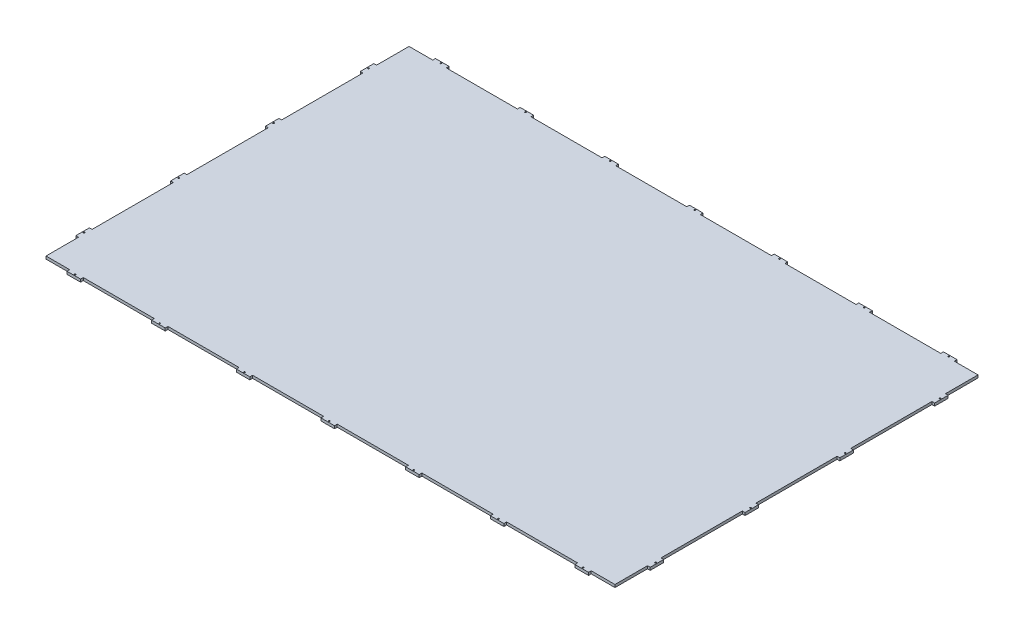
from build123d import *

# Parameters (mm, degrees)
SKIZZE1_W                       = 848
SKIZZE1_H                       = 544
AUFSATZ_LINEAR_AUSTRAGEN1_DEPTH = 4
SKIZZE2_W                       = 39
SKIZZE2_H                       = 4
SKIZZE2_W_2                     = 105
SCHNITT_LINEAR_AUSTRAGEN1_DEPTH = 504.761848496
SKIZZE3_W                       = 4
SKIZZE3_H                       = 48
SKIZZE3_H_2                     = 120
SCHNITT_LINEAR_AUSTRAGEN2_DEPTH = 504.761848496
F_2_0_2_DURCHMESSER_BOHRUNG1_D  = 2


with BuildPart() as part:
    # Skizze1 → Aufsatz-Linear austragen1 (new body)
    with BuildSketch(Plane(origin=(0, 0, 0), x_dir=(1, 0, 0), z_dir=(0, 1, 0))):
        Rectangle(SKIZZE1_W, SKIZZE1_H)
    extrude(amount=AUFSATZ_LINEAR_AUSTRAGEN1_DEPTH)

    # Skizze2 → Schnitt-Linear austragen1 (cut, through all)
    with BuildSketch(Plane(origin=(0, 4, 0), x_dir=(1, 0, 0), z_dir=(0, 1, 0))):
        with Locations((-404.5, -270)):
            Rectangle(SKIZZE2_W, SKIZZE2_H)
        with Locations((-312.5, -270)):
            Rectangle(SKIZZE2_W_2, SKIZZE2_H)
        with Locations((-187.5, -270)):
            Rectangle(SKIZZE2_W_2, SKIZZE2_H)
        with Locations((-62.5, -270)):
            Rectangle(SKIZZE2_W_2, SKIZZE2_H)
        with Locations((62.5, -270)):
            Rectangle(SKIZZE2_W_2, SKIZZE2_H)
        with Locations((187.5, -270)):
            Rectangle(SKIZZE2_W_2, SKIZZE2_H)
        with Locations((312.5, -270)):
            Rectangle(SKIZZE2_W_2, SKIZZE2_H)
        with Locations((404.5, -270)):
            Rectangle(SKIZZE2_W, SKIZZE2_H)
    schnitt_linear_austragen1 = extrude(amount=-SCHNITT_LINEAR_AUSTRAGEN1_DEPTH, mode=Mode.SUBTRACT)

    # Spiegeln1: Schnitt-Linear austragen1 across plane
    add(schnitt_linear_austragen1.mirror(Plane.XY), mode=Mode.SUBTRACT)

    # Skizze3 → Schnitt-Linear austragen2 (cut, through all)
    with BuildSketch(Plane(origin=(0, 4, 0), x_dir=(1, 0, 0), z_dir=(0, 1, 0))):
        with Locations((-422, 244)):
            Rectangle(SKIZZE3_W, SKIZZE3_H)
        with Locations((-422, 140)):
            Rectangle(SKIZZE3_W, SKIZZE3_H_2)
        with Locations((-422, 0)):
            Rectangle(SKIZZE3_W, SKIZZE3_H_2)
        with Locations((-422, -140)):
            Rectangle(SKIZZE3_W, SKIZZE3_H_2)
        with Locations((-422, -244)):
            Rectangle(SKIZZE3_W, SKIZZE3_H)
    schnitt_linear_austragen2 = extrude(amount=-SCHNITT_LINEAR_AUSTRAGEN2_DEPTH, mode=Mode.SUBTRACT)

    # Spiegeln2: Schnitt-Linear austragen2 across plane
    add(schnitt_linear_austragen2.mirror(Plane(origin=(0, 0, 0), x_dir=(0, 0, 1), z_dir=(1, 0, 0))), mode=Mode.SUBTRACT)

    # 2.0 _2_ Durchmesser Bohrung1 (through all)
    with Locations(Plane(origin=(0, 4, 0), x_dir=(1, 0, 0), z_dir=(0, 1, 0))):
        with Locations((-375, 270), (-250, 270), (-125, 270), (0, 270), (125, 270), (250, 270), (375, 270), (422, 210), (422, 70), (422, -70), (422, -210), (375, -270), (250, -270), (125, -270), (0, -270), (-125, -270), (-250, -270), (-375, -270), (-422, -210), (-422, -70), (-422, 70), (-422, 210)):
            Hole(F_2_0_2_DURCHMESSER_BOHRUNG1_D / 2)


solid = part.part
